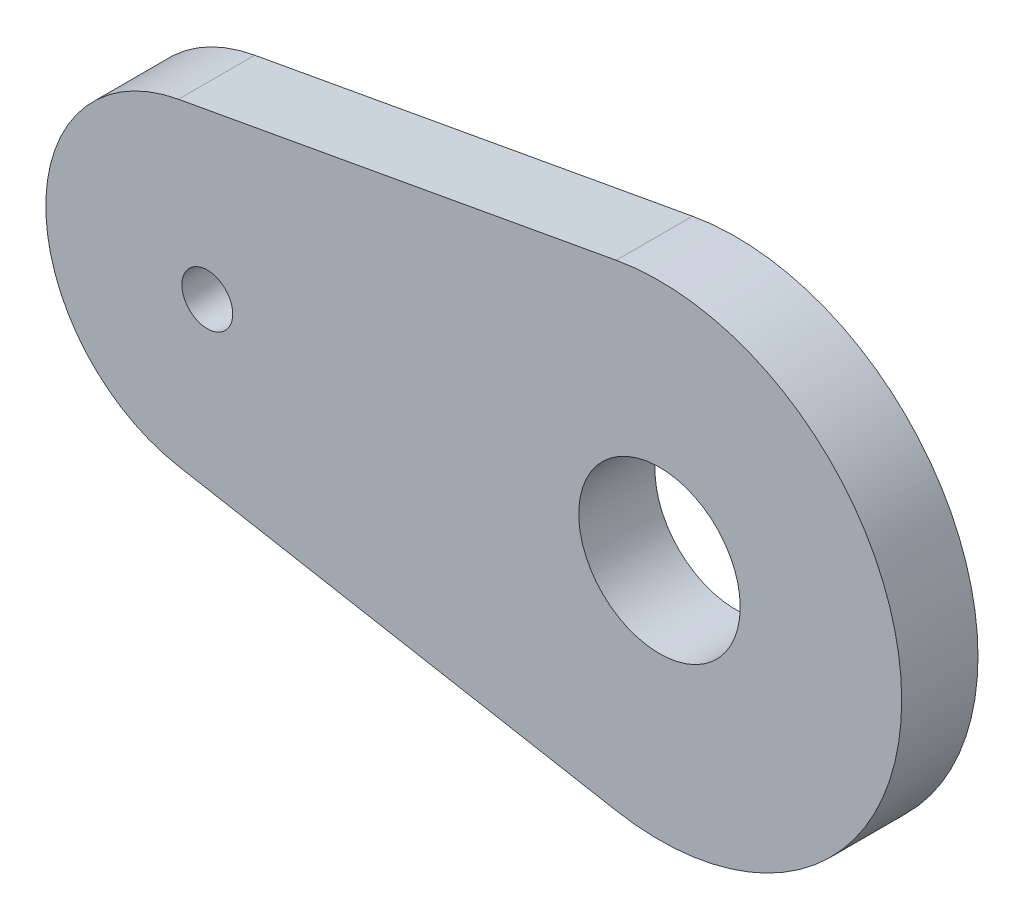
ISO-10303-21;
HEADER;
FILE_DESCRIPTION(('STEP AP214'),'2;1');
FILE_NAME('part.step','',(''),(''),'','','');
FILE_SCHEMA(('AUTOMOTIVE_DESIGN { 1 0 10303 214 1 1 1 1 }'));
ENDSEC;
DATA;
#1=APPLICATION_CONTEXT('core data for automotive mechanical design processes');
#2=APPLICATION_PROTOCOL_DEFINITION('international standard','automotive_design',2000,#1);
#3=PRODUCT_CONTEXT('',#1,'mechanical');
#4=PRODUCT('Part','Part','',(#3));
#5=PRODUCT_RELATED_PRODUCT_CATEGORY('part','',(#4));
#6=PRODUCT_DEFINITION_FORMATION('','',#4);
#7=PRODUCT_DEFINITION_CONTEXT('part definition',#1,'design');
#8=PRODUCT_DEFINITION('design','',#6,#7);
#9=PRODUCT_DEFINITION_SHAPE('','',#8);
#10=(LENGTH_UNIT() NAMED_UNIT(*) SI_UNIT(.MILLI.,.METRE.));
#11=(NAMED_UNIT(*) PLANE_ANGLE_UNIT() SI_UNIT($,.RADIAN.));
#12=(NAMED_UNIT(*) SI_UNIT($,.STERADIAN.) SOLID_ANGLE_UNIT());
#13=UNCERTAINTY_MEASURE_WITH_UNIT(LENGTH_MEASURE(1.E-05),#10,'distance_accuracy_value','');
#14=(GEOMETRIC_REPRESENTATION_CONTEXT(3) GLOBAL_UNCERTAINTY_ASSIGNED_CONTEXT((#13)) GLOBAL_UNIT_ASSIGNED_CONTEXT((#10,
#11,#12)) REPRESENTATION_CONTEXT('',''));
#15=CARTESIAN_POINT('',(0.,0.,0.));
#16=DIRECTION('',(0.,0.,1.));
#17=DIRECTION('',(1.,0.,0.));
#18=AXIS2_PLACEMENT_3D('',#15,#16,#17);
#19=CARTESIAN_POINT('',(17.78,0.,3.));
#20=DIRECTION('',(0.,0.,-1.));
#21=DIRECTION('',(-1.,0.,0.));
#22=AXIS2_PLACEMENT_3D('',#19,#20,#21);
#23=PLANE('',#22);
#24=CARTESIAN_POINT('',(17.78,0.,3.));
#25=DIRECTION('',(0.,0.,1.));
#26=DIRECTION('',(-1.,0.,0.));
#27=AXIS2_PLACEMENT_3D('',#24,#25,#26);
#28=CIRCLE('',#27,9.525);
#29=CARTESIAN_POINT('',(16.0791071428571,-9.371904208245,3.));
#30=VERTEX_POINT('',#29);
#31=CARTESIAN_POINT('',(16.0791071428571,9.371904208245,3.));
#32=VERTEX_POINT('',#31);
#33=EDGE_CURVE('E93',#30,#32,#28,.T.);
#34=ORIENTED_EDGE('',*,*,#33,.T.);
#35=DIRECTION('',(-0.983926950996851,-0.178571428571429,0.));
#36=VECTOR('',#35,1.);
#37=CARTESIAN_POINT('',(-1.13392857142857,6.24793613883,3.));
#38=LINE('',#37,#36);
#39=CARTESIAN_POINT('',(-1.13392857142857,6.24793613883,3.));
#40=VERTEX_POINT('',#39);
#41=EDGE_CURVE('E88',#32,#40,#38,.T.);
#42=ORIENTED_EDGE('',*,*,#41,.T.);
#43=CARTESIAN_POINT('',(0.,0.,3.));
#44=DIRECTION('',(0.,0.,1.));
#45=DIRECTION('',(1.,0.,0.));
#46=AXIS2_PLACEMENT_3D('',#43,#44,#45);
#47=CIRCLE('',#46,6.35);
#48=CARTESIAN_POINT('',(-1.13392857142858,-6.24793613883,3.));
#49=VERTEX_POINT('',#48);
#50=EDGE_CURVE('E91',#40,#49,#47,.T.);
#51=ORIENTED_EDGE('',*,*,#50,.T.);
#52=DIRECTION('',(0.983926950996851,-0.178571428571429,0.));
#53=VECTOR('',#52,1.);
#54=CARTESIAN_POINT('',(-1.13392857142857,-6.24793613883,3.));
#55=LINE('',#54,#53);
#56=EDGE_CURVE('E58',#49,#30,#55,.T.);
#57=ORIENTED_EDGE('',*,*,#56,.T.);
#58=EDGE_LOOP('',(#34,#42,#51,#57));
#59=FACE_BOUND('',#58,.T.);
#60=CARTESIAN_POINT('',(0.,0.,3.));
#61=DIRECTION('',(0.,0.,1.));
#62=DIRECTION('',(1.,0.,0.));
#63=AXIS2_PLACEMENT_3D('',#60,#61,#62);
#64=CIRCLE('',#63,1.);
#65=CARTESIAN_POINT('',(1.,0.,3.));
#66=VERTEX_POINT('',#65);
#67=EDGE_CURVE('E108',#66,#66,#64,.T.);
#68=ORIENTED_EDGE('',*,*,#67,.F.);
#69=EDGE_LOOP('',(#68));
#70=FACE_BOUND('',#69,.T.);
#71=CARTESIAN_POINT('',(17.78,0.,3.));
#72=DIRECTION('',(0.,0.,1.));
#73=DIRECTION('',(1.,0.,0.));
#74=AXIS2_PLACEMENT_3D('',#71,#72,#73);
#75=CIRCLE('',#74,3.175);
#76=CARTESIAN_POINT('',(20.955,0.,3.));
#77=VERTEX_POINT('',#76);
#78=EDGE_CURVE('E123',#77,#77,#75,.T.);
#79=ORIENTED_EDGE('',*,*,#78,.F.);
#80=EDGE_LOOP('',(#79));
#81=FACE_BOUND('',#80,.T.);
#82=ADVANCED_FACE('F41',(#59,#70,#81),#23,.F.);
#83=CARTESIAN_POINT('',(17.78,0.,0.));
#84=DIRECTION('',(0.,0.,-1.));
#85=DIRECTION('',(-1.,0.,0.));
#86=AXIS2_PLACEMENT_3D('',#83,#84,#85);
#87=PLANE('',#86);
#88=CARTESIAN_POINT('',(0.,0.,0.));
#89=DIRECTION('',(0.,0.,1.));
#90=DIRECTION('',(1.,0.,0.));
#91=AXIS2_PLACEMENT_3D('',#88,#89,#90);
#92=CIRCLE('',#91,1.);
#93=CARTESIAN_POINT('',(1.,0.,0.));
#94=VERTEX_POINT('',#93);
#95=EDGE_CURVE('E120',#94,#94,#92,.T.);
#96=ORIENTED_EDGE('',*,*,#95,.T.);
#97=EDGE_LOOP('',(#96));
#98=FACE_BOUND('',#97,.T.);
#99=CARTESIAN_POINT('',(17.78,0.,0.));
#100=DIRECTION('',(0.,0.,1.));
#101=DIRECTION('',(-1.,0.,0.));
#102=AXIS2_PLACEMENT_3D('',#99,#100,#101);
#103=CIRCLE('',#102,9.525);
#104=CARTESIAN_POINT('',(16.0791071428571,-9.371904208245,0.));
#105=VERTEX_POINT('',#104);
#106=CARTESIAN_POINT('',(16.0791071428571,9.371904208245,0.));
#107=VERTEX_POINT('',#106);
#108=EDGE_CURVE('E105',#105,#107,#103,.T.);
#109=ORIENTED_EDGE('',*,*,#108,.F.);
#110=DIRECTION('',(0.983926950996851,-0.178571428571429,0.));
#111=VECTOR('',#110,1.);
#112=CARTESIAN_POINT('',(-1.13392857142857,-6.24793613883,0.));
#113=LINE('',#112,#111);
#114=CARTESIAN_POINT('',(-1.13392857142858,-6.24793613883,0.));
#115=VERTEX_POINT('',#114);
#116=EDGE_CURVE('E81',#115,#105,#113,.T.);
#117=ORIENTED_EDGE('',*,*,#116,.F.);
#118=CARTESIAN_POINT('',(0.,0.,0.));
#119=DIRECTION('',(0.,0.,1.));
#120=DIRECTION('',(1.,0.,0.));
#121=AXIS2_PLACEMENT_3D('',#118,#119,#120);
#122=CIRCLE('',#121,6.35);
#123=CARTESIAN_POINT('',(-1.13392857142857,6.24793613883,0.));
#124=VERTEX_POINT('',#123);
#125=EDGE_CURVE('E75',#124,#115,#122,.T.);
#126=ORIENTED_EDGE('',*,*,#125,.F.);
#127=DIRECTION('',(-0.983926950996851,-0.178571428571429,0.));
#128=VECTOR('',#127,1.);
#129=CARTESIAN_POINT('',(-1.13392857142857,6.24793613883,0.));
#130=LINE('',#129,#128);
#131=EDGE_CURVE('E97',#107,#124,#130,.T.);
#132=ORIENTED_EDGE('',*,*,#131,.F.);
#133=EDGE_LOOP('',(#109,#117,#126,#132));
#134=FACE_BOUND('',#133,.T.);
#135=CARTESIAN_POINT('',(17.78,0.,0.));
#136=DIRECTION('',(0.,0.,1.));
#137=DIRECTION('',(1.,0.,0.));
#138=AXIS2_PLACEMENT_3D('',#135,#136,#137);
#139=CIRCLE('',#138,3.175);
#140=CARTESIAN_POINT('',(20.955,0.,0.));
#141=VERTEX_POINT('',#140);
#142=EDGE_CURVE('E126',#141,#141,#139,.T.);
#143=ORIENTED_EDGE('',*,*,#142,.T.);
#144=EDGE_LOOP('',(#143));
#145=FACE_BOUND('',#144,.T.);
#146=ADVANCED_FACE('F116',(#98,#134,#145),#87,.T.);
#147=CARTESIAN_POINT('',(17.78,0.,3.));
#148=DIRECTION('',(0.,0.,-1.));
#149=DIRECTION('',(-1.,0.,0.));
#150=AXIS2_PLACEMENT_3D('',#147,#148,#149);
#151=CYLINDRICAL_SURFACE('',#150,9.525);
#152=ORIENTED_EDGE('',*,*,#108,.T.);
#153=DIRECTION('',(0.,0.,-1.));
#154=VECTOR('',#153,1.);
#155=CARTESIAN_POINT('',(16.0791071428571,9.371904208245,3.));
#156=LINE('',#155,#154);
#157=EDGE_CURVE('E11',#32,#107,#156,.T.);
#158=ORIENTED_EDGE('',*,*,#157,.F.);
#159=ORIENTED_EDGE('',*,*,#33,.F.);
#160=DIRECTION('',(0.,0.,-1.));
#161=VECTOR('',#160,1.);
#162=CARTESIAN_POINT('',(16.0791071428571,-9.371904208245,3.));
#163=LINE('',#162,#161);
#164=EDGE_CURVE('E101',#30,#105,#163,.T.);
#165=ORIENTED_EDGE('',*,*,#164,.T.);
#166=EDGE_LOOP('',(#152,#158,#159,#165));
#167=FACE_BOUND('',#166,.T.);
#168=ADVANCED_FACE('F43',(#167),#151,.T.);
#169=CARTESIAN_POINT('',(-1.13392857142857,6.24793613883,3.));
#170=DIRECTION('',(0.178571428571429,-0.983926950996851,0.));
#171=DIRECTION('',(0.983926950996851,0.178571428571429,0.));
#172=AXIS2_PLACEMENT_3D('',#169,#170,#171);
#173=PLANE('',#172);
#174=ORIENTED_EDGE('',*,*,#131,.T.);
#175=DIRECTION('',(0.,0.,-1.));
#176=VECTOR('',#175,1.);
#177=CARTESIAN_POINT('',(-1.13392857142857,6.24793613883,3.));
#178=LINE('',#177,#176);
#179=EDGE_CURVE('E50',#40,#124,#178,.T.);
#180=ORIENTED_EDGE('',*,*,#179,.F.);
#181=ORIENTED_EDGE('',*,*,#41,.F.);
#182=ORIENTED_EDGE('',*,*,#157,.T.);
#183=EDGE_LOOP('',(#174,#180,#181,#182));
#184=FACE_BOUND('',#183,.T.);
#185=ADVANCED_FACE('F96',(#184),#173,.F.);
#186=CARTESIAN_POINT('',(0.,0.,3.));
#187=DIRECTION('',(0.,0.,-1.));
#188=DIRECTION('',(-1.,0.,0.));
#189=AXIS2_PLACEMENT_3D('',#186,#187,#188);
#190=CYLINDRICAL_SURFACE('',#189,6.35);
#191=ORIENTED_EDGE('',*,*,#125,.T.);
#192=DIRECTION('',(0.,0.,-1.));
#193=VECTOR('',#192,1.);
#194=CARTESIAN_POINT('',(-1.13392857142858,-6.24793613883,3.));
#195=LINE('',#194,#193);
#196=EDGE_CURVE('E98',#49,#115,#195,.T.);
#197=ORIENTED_EDGE('',*,*,#196,.F.);
#198=ORIENTED_EDGE('',*,*,#50,.F.);
#199=ORIENTED_EDGE('',*,*,#179,.T.);
#200=EDGE_LOOP('',(#191,#197,#198,#199));
#201=FACE_BOUND('',#200,.T.);
#202=ADVANCED_FACE('F99',(#201),#190,.T.);
#203=CARTESIAN_POINT('',(-1.13392857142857,-6.24793613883,3.));
#204=DIRECTION('',(0.178571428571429,0.983926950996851,0.));
#205=DIRECTION('',(-0.983926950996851,0.178571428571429,0.));
#206=AXIS2_PLACEMENT_3D('',#203,#204,#205);
#207=PLANE('',#206);
#208=ORIENTED_EDGE('',*,*,#116,.T.);
#209=ORIENTED_EDGE('',*,*,#164,.F.);
#210=ORIENTED_EDGE('',*,*,#56,.F.);
#211=ORIENTED_EDGE('',*,*,#196,.T.);
#212=EDGE_LOOP('',(#208,#209,#210,#211));
#213=FACE_BOUND('',#212,.T.);
#214=ADVANCED_FACE('F113',(#213),#207,.F.);
#215=CARTESIAN_POINT('',(0.,0.,3.));
#216=DIRECTION('',(0.,0.,-1.));
#217=DIRECTION('',(-1.,0.,0.));
#218=AXIS2_PLACEMENT_3D('',#215,#216,#217);
#219=CYLINDRICAL_SURFACE('',#218,1.);
#220=ORIENTED_EDGE('',*,*,#67,.T.);
#221=EDGE_LOOP('',(#220));
#222=FACE_BOUND('',#221,.T.);
#223=ORIENTED_EDGE('',*,*,#95,.F.);
#224=EDGE_LOOP('',(#223));
#225=FACE_BOUND('',#224,.T.);
#226=ADVANCED_FACE('F143',(#222,#225),#219,.F.);
#227=CARTESIAN_POINT('',(17.78,0.,3.));
#228=DIRECTION('',(0.,0.,-1.));
#229=DIRECTION('',(-1.,0.,0.));
#230=AXIS2_PLACEMENT_3D('',#227,#228,#229);
#231=CYLINDRICAL_SURFACE('',#230,3.175);
#232=ORIENTED_EDGE('',*,*,#78,.T.);
#233=EDGE_LOOP('',(#232));
#234=FACE_BOUND('',#233,.T.);
#235=ORIENTED_EDGE('',*,*,#142,.F.);
#236=EDGE_LOOP('',(#235));
#237=FACE_BOUND('',#236,.T.);
#238=ADVANCED_FACE('F132',(#234,#237),#231,.F.);
#239=CLOSED_SHELL('',(#82,#146,#168,#185,#202,#214,#226,#238));
#240=MANIFOLD_SOLID_BREP('B2',#239);
#241=ADVANCED_BREP_SHAPE_REPRESENTATION('',(#18,#240),#14);
#242=SHAPE_DEFINITION_REPRESENTATION(#9,#241);
ENDSEC;
END-ISO-10303-21;
